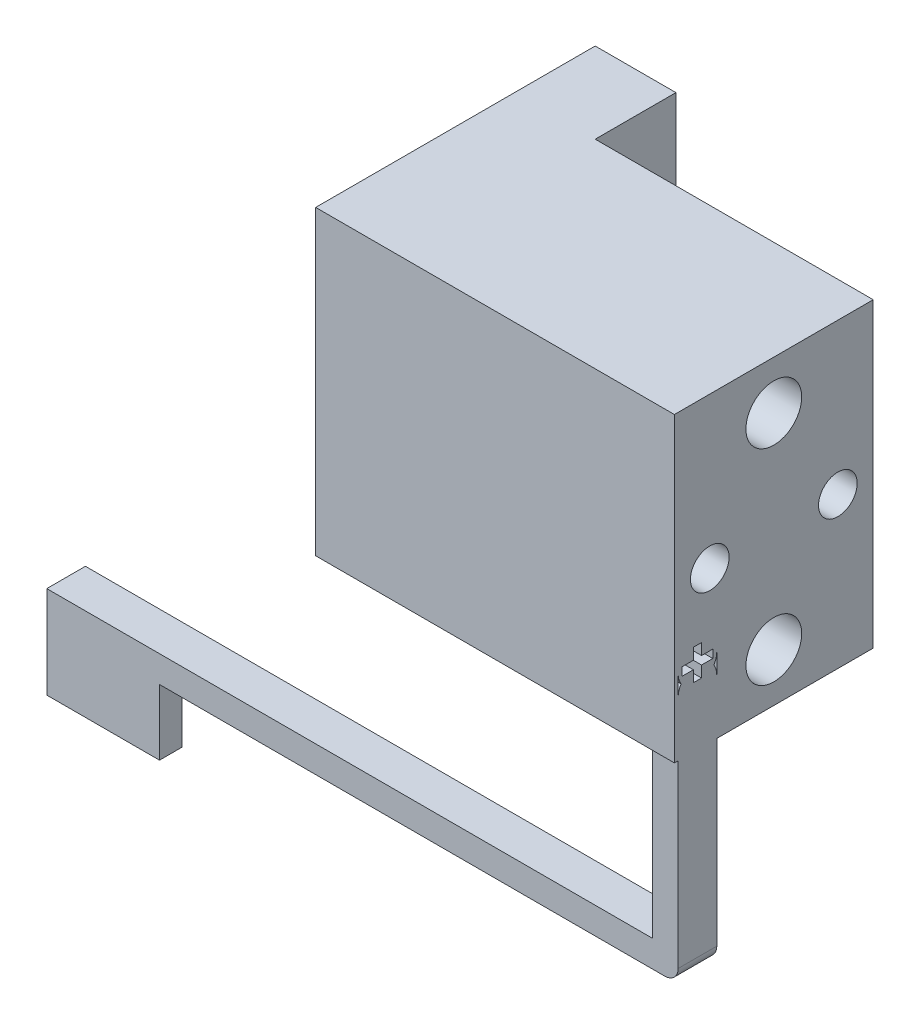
ISO-10303-21;
HEADER;
FILE_DESCRIPTION(('STEP AP214'),'2;1');
FILE_NAME('part.step','',(''),(''),'','','');
FILE_SCHEMA(('AUTOMOTIVE_DESIGN { 1 0 10303 214 1 1 1 1 }'));
ENDSEC;
DATA;
#1=APPLICATION_CONTEXT('core data for automotive mechanical design processes');
#2=APPLICATION_PROTOCOL_DEFINITION('international standard','automotive_design',2000,#1);
#3=PRODUCT_CONTEXT('',#1,'mechanical');
#4=PRODUCT('Part','Part','',(#3));
#5=PRODUCT_RELATED_PRODUCT_CATEGORY('part','',(#4));
#6=PRODUCT_DEFINITION_FORMATION('','',#4);
#7=PRODUCT_DEFINITION_CONTEXT('part definition',#1,'design');
#8=PRODUCT_DEFINITION('design','',#6,#7);
#9=PRODUCT_DEFINITION_SHAPE('','',#8);
#10=(LENGTH_UNIT() NAMED_UNIT(*) SI_UNIT(.MILLI.,.METRE.));
#11=(NAMED_UNIT(*) PLANE_ANGLE_UNIT() SI_UNIT($,.RADIAN.));
#12=(NAMED_UNIT(*) SI_UNIT($,.STERADIAN.) SOLID_ANGLE_UNIT());
#13=UNCERTAINTY_MEASURE_WITH_UNIT(LENGTH_MEASURE(1.E-05),#10,'distance_accuracy_value','');
#14=(GEOMETRIC_REPRESENTATION_CONTEXT(3) GLOBAL_UNCERTAINTY_ASSIGNED_CONTEXT((#13)) GLOBAL_UNIT_ASSIGNED_CONTEXT((#10,
#11,#12)) REPRESENTATION_CONTEXT('',''));
#15=CARTESIAN_POINT('',(0.,0.,0.));
#16=DIRECTION('',(0.,0.,1.));
#17=DIRECTION('',(1.,0.,0.));
#18=AXIS2_PLACEMENT_3D('',#15,#16,#17);
#19=CARTESIAN_POINT('',(17.6065,-4.73456999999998,29.7609599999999));
#20=DIRECTION('',(0.,0.,-1.));
#21=DIRECTION('',(-1.,0.,0.));
#22=AXIS2_PLACEMENT_3D('',#19,#20,#21);
#23=PLANE('',#22);
#24=DIRECTION('',(0.,1.,0.));
#25=VECTOR('',#24,1.);
#26=CARTESIAN_POINT('',(14.114,-1.05156999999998,29.7609599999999));
#27=LINE('',#26,#25);
#28=CARTESIAN_POINT('',(14.114,-2.70257000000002,29.7609599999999));
#29=VERTEX_POINT('',#28);
#30=CARTESIAN_POINT('',(14.114,-6.76657000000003,29.76096));
#31=VERTEX_POINT('',#30);
#32=EDGE_CURVE('E138',#29,#31,#27,.F.);
#33=ORIENTED_EDGE('',*,*,#32,.F.);
#34=DIRECTION('',(1.,0.,0.));
#35=VECTOR('',#34,1.);
#36=CARTESIAN_POINT('',(32.8465,-2.70257000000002,29.7609599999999));
#37=LINE('',#36,#35);
#38=CARTESIAN_POINT('',(21.099,-2.70257000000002,29.7609599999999));
#39=VERTEX_POINT('',#38);
#40=EDGE_CURVE('E316',#29,#39,#37,.T.);
#41=ORIENTED_EDGE('',*,*,#40,.T.);
#42=DIRECTION('',(0.,1.,0.));
#43=VECTOR('',#42,1.);
#44=CARTESIAN_POINT('',(21.099,-6.76657000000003,29.76096));
#45=LINE('',#44,#43);
#46=CARTESIAN_POINT('',(21.099,-6.76657000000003,29.76096));
#47=VERTEX_POINT('',#46);
#48=EDGE_CURVE('E277',#47,#39,#45,.T.);
#49=ORIENTED_EDGE('',*,*,#48,.F.);
#50=DIRECTION('',(1.,0.,0.));
#51=VECTOR('',#50,1.);
#52=CARTESIAN_POINT('',(14.114,-6.76657000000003,29.76096));
#53=LINE('',#52,#51);
#54=EDGE_CURVE('E278',#31,#47,#53,.T.);
#55=ORIENTED_EDGE('',*,*,#54,.F.);
#56=EDGE_LOOP('',(#33,#41,#49,#55));
#57=FACE_BOUND('',#56,.T.);
#58=ADVANCED_FACE('F32',(#57),#23,.T.);
#59=CARTESIAN_POINT('',(32.8465,-1.05157000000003,29.96035));
#60=DIRECTION('',(0.,1.,0.));
#61=DIRECTION('',(0.,0.,1.));
#62=AXIS2_PLACEMENT_3D('',#59,#60,#61);
#63=PLANE('',#62);
#64=DIRECTION('',(1.,0.,0.));
#65=VECTOR('',#64,1.);
#66=CARTESIAN_POINT('',(14.114,-1.05156999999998,31.15796));
#67=LINE('',#66,#65);
#68=CARTESIAN_POINT('',(51.6425,-1.05156999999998,31.15796));
#69=VERTEX_POINT('',#68);
#70=CARTESIAN_POINT('',(14.114,-1.05156999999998,31.15796));
#71=VERTEX_POINT('',#70);
#72=EDGE_CURVE('E146',#69,#71,#67,.F.);
#73=ORIENTED_EDGE('',*,*,#72,.F.);
#74=DIRECTION('',(0.,0.,1.));
#75=VECTOR('',#74,1.);
#76=CARTESIAN_POINT('',(51.6425,-1.05156999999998,31.15796));
#77=LINE('',#76,#75);
#78=CARTESIAN_POINT('',(51.6425,-1.05156999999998,28.76274));
#79=VERTEX_POINT('',#78);
#80=EDGE_CURVE('E328',#79,#69,#77,.T.);
#81=ORIENTED_EDGE('',*,*,#80,.F.);
#82=DIRECTION('',(-1.,0.,0.));
#83=VECTOR('',#82,1.);
#84=CARTESIAN_POINT('',(51.579,-1.05156999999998,28.76274));
#85=LINE('',#84,#83);
#86=CARTESIAN_POINT('',(14.114,-1.05156999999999,28.76274));
#87=VERTEX_POINT('',#86);
#88=EDGE_CURVE('E305',#87,#79,#85,.F.);
#89=ORIENTED_EDGE('',*,*,#88,.F.);
#90=DIRECTION('',(0.,0.,1.));
#91=VECTOR('',#90,1.);
#92=CARTESIAN_POINT('',(14.114,-1.05156999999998,28.76274));
#93=LINE('',#92,#91);
#94=EDGE_CURVE('E124',#71,#87,#93,.F.);
#95=ORIENTED_EDGE('',*,*,#94,.F.);
#96=EDGE_LOOP('',(#73,#81,#89,#95));
#97=FACE_BOUND('',#96,.T.);
#98=ADVANCED_FACE('F417',(#97),#63,.T.);
#99=CARTESIAN_POINT('',(14.114,-1.05156999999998,28.76274));
#100=DIRECTION('',(-1.,0.,0.));
#101=DIRECTION('',(0.,0.,1.));
#102=AXIS2_PLACEMENT_3D('',#99,#100,#101);
#103=PLANE('',#102);
#104=ORIENTED_EDGE('',*,*,#94,.T.);
#105=DIRECTION('',(0.,1.,0.));
#106=VECTOR('',#105,1.);
#107=CARTESIAN_POINT('',(14.114,-1.05156999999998,28.76274));
#108=LINE('',#107,#106);
#109=CARTESIAN_POINT('',(14.114,-2.70256999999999,28.76274));
#110=VERTEX_POINT('',#109);
#111=EDGE_CURVE('E307',#110,#87,#108,.T.);
#112=ORIENTED_EDGE('',*,*,#111,.F.);
#113=DIRECTION('',(0.,0.,1.));
#114=VECTOR('',#113,1.);
#115=CARTESIAN_POINT('',(14.114,-2.70257000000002,29.96035));
#116=LINE('',#115,#114);
#117=EDGE_CURVE('E314',#110,#29,#116,.T.);
#118=ORIENTED_EDGE('',*,*,#117,.T.);
#119=ORIENTED_EDGE('',*,*,#32,.T.);
#120=DIRECTION('',(0.,0.,-1.));
#121=VECTOR('',#120,1.);
#122=CARTESIAN_POINT('',(14.114,-6.76657000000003,31.15796));
#123=LINE('',#122,#121);
#124=CARTESIAN_POINT('',(14.114,-6.76657000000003,31.15796));
#125=VERTEX_POINT('',#124);
#126=EDGE_CURVE('E273',#125,#31,#123,.T.);
#127=ORIENTED_EDGE('',*,*,#126,.F.);
#128=DIRECTION('',(0.,1.,0.));
#129=VECTOR('',#128,1.);
#130=CARTESIAN_POINT('',(14.114,-1.05156999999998,31.15796));
#131=LINE('',#130,#129);
#132=EDGE_CURVE('E266',#71,#125,#131,.F.);
#133=ORIENTED_EDGE('',*,*,#132,.F.);
#134=EDGE_LOOP('',(#104,#112,#118,#119,#127,#133));
#135=FACE_BOUND('',#134,.T.);
#136=ADVANCED_FACE('F274',(#135),#103,.T.);
#137=CARTESIAN_POINT('',(14.114,-6.76657000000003,31.15796));
#138=DIRECTION('',(0.,-1.,0.));
#139=DIRECTION('',(0.,0.,-1.));
#140=AXIS2_PLACEMENT_3D('',#137,#138,#139);
#141=PLANE('',#140);
#142=DIRECTION('',(1.,0.,0.));
#143=VECTOR('',#142,1.);
#144=CARTESIAN_POINT('',(14.114,-6.76657000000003,31.15796));
#145=LINE('',#144,#143);
#146=CARTESIAN_POINT('',(21.099,-6.76657000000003,31.15796));
#147=VERTEX_POINT('',#146);
#148=EDGE_CURVE('E270',#125,#147,#145,.T.);
#149=ORIENTED_EDGE('',*,*,#148,.F.);
#150=ORIENTED_EDGE('',*,*,#126,.T.);
#151=ORIENTED_EDGE('',*,*,#54,.T.);
#152=DIRECTION('',(0.,0.,-1.));
#153=VECTOR('',#152,1.);
#154=CARTESIAN_POINT('',(21.099,-6.76657000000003,31.15796));
#155=LINE('',#154,#153);
#156=EDGE_CURVE('E282',#147,#47,#155,.T.);
#157=ORIENTED_EDGE('',*,*,#156,.F.);
#158=EDGE_LOOP('',(#149,#150,#151,#157));
#159=FACE_BOUND('',#158,.T.);
#160=ADVANCED_FACE('F280',(#159),#141,.T.);
#161=CARTESIAN_POINT('',(21.099,-6.76657000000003,31.15796));
#162=DIRECTION('',(1.,0.,0.));
#163=DIRECTION('',(0.,0.,-1.));
#164=AXIS2_PLACEMENT_3D('',#161,#162,#163);
#165=PLANE('',#164);
#166=DIRECTION('',(0.,1.,0.));
#167=VECTOR('',#166,1.);
#168=CARTESIAN_POINT('',(21.099,-1.05156999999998,31.15796));
#169=LINE('',#168,#167);
#170=CARTESIAN_POINT('',(21.099,-2.70257000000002,31.15796));
#171=VERTEX_POINT('',#170);
#172=EDGE_CURVE('E284',#147,#171,#169,.T.);
#173=ORIENTED_EDGE('',*,*,#172,.F.);
#174=ORIENTED_EDGE('',*,*,#156,.T.);
#175=ORIENTED_EDGE('',*,*,#48,.T.);
#176=DIRECTION('',(0.,0.,1.));
#177=VECTOR('',#176,1.);
#178=CARTESIAN_POINT('',(21.099,-2.70257000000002,29.96035));
#179=LINE('',#178,#177);
#180=EDGE_CURVE('E324',#39,#171,#179,.T.);
#181=ORIENTED_EDGE('',*,*,#180,.T.);
#182=EDGE_LOOP('',(#173,#174,#175,#181));
#183=FACE_BOUND('',#182,.T.);
#184=ADVANCED_FACE('F404',(#183),#165,.T.);
#185=CARTESIAN_POINT('',(32.8465,-2.70257000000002,29.96035));
#186=DIRECTION('',(0.,1.,0.));
#187=DIRECTION('',(0.,0.,1.));
#188=AXIS2_PLACEMENT_3D('',#185,#186,#187);
#189=PLANE('',#188);
#190=ORIENTED_EDGE('',*,*,#40,.F.);
#191=ORIENTED_EDGE('',*,*,#117,.F.);
#192=DIRECTION('',(-1.,0.,0.));
#193=VECTOR('',#192,1.);
#194=CARTESIAN_POINT('',(51.579,-2.70256999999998,28.76274));
#195=LINE('',#194,#193);
#196=CARTESIAN_POINT('',(52.4045,-2.70256999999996,28.76274));
#197=VERTEX_POINT('',#196);
#198=EDGE_CURVE('E311',#197,#110,#195,.T.);
#199=ORIENTED_EDGE('',*,*,#198,.F.);
#200=DIRECTION('',(0.,0.,1.));
#201=VECTOR('',#200,1.);
#202=CARTESIAN_POINT('',(52.4045,-2.70256999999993,28.76274));
#203=LINE('',#202,#201);
#204=CARTESIAN_POINT('',(52.4045,-2.70256999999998,31.15796));
#205=VERTEX_POINT('',#204);
#206=EDGE_CURVE('E112',#205,#197,#203,.F.);
#207=ORIENTED_EDGE('',*,*,#206,.F.);
#208=DIRECTION('',(1.,0.,0.));
#209=VECTOR('',#208,1.);
#210=CARTESIAN_POINT('',(14.114,-2.70257000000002,31.15796));
#211=LINE('',#210,#209);
#212=EDGE_CURVE('E286',#171,#205,#211,.T.);
#213=ORIENTED_EDGE('',*,*,#212,.F.);
#214=ORIENTED_EDGE('',*,*,#180,.F.);
#215=EDGE_LOOP('',(#190,#191,#199,#207,#213,#214));
#216=FACE_BOUND('',#215,.T.);
#217=ADVANCED_FACE('F409',(#216),#189,.F.);
#218=CARTESIAN_POINT('',(36.005,18.61565,16.5701));
#219=DIRECTION('',(-1.,0.,0.));
#220=DIRECTION('',(0.,0.,1.));
#221=AXIS2_PLACEMENT_3D('',#218,#219,#220);
#222=PLANE('',#221);
#223=DIRECTION('',(0.,1.,0.));
#224=VECTOR('',#223,1.);
#225=CARTESIAN_POINT('',(36.005,18.61565,14.0701));
#226=LINE('',#225,#224);
#227=CARTESIAN_POINT('',(36.005,9.26844999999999,14.0701));
#228=VERTEX_POINT('',#227);
#229=CARTESIAN_POINT('',(36.005,27.96285,14.0701));
#230=VERTEX_POINT('',#229);
#231=EDGE_CURVE('E398',#228,#230,#226,.T.);
#232=ORIENTED_EDGE('',*,*,#231,.T.);
#233=DIRECTION('',(0.,0.,-1.));
#234=VECTOR('',#233,1.);
#235=CARTESIAN_POINT('',(36.005,27.96285,25.2296));
#236=LINE('',#235,#234);
#237=CARTESIAN_POINT('',(36.005,27.96285,19.0701));
#238=VERTEX_POINT('',#237);
#239=EDGE_CURVE('E445',#230,#238,#236,.F.);
#240=ORIENTED_EDGE('',*,*,#239,.T.);
#241=DIRECTION('',(0.,1.,0.));
#242=VECTOR('',#241,1.);
#243=CARTESIAN_POINT('',(36.005,18.61565,19.0700999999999));
#244=LINE('',#243,#242);
#245=CARTESIAN_POINT('',(36.005,9.26844999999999,19.0701));
#246=VERTEX_POINT('',#245);
#247=EDGE_CURVE('E441',#246,#238,#244,.T.);
#248=ORIENTED_EDGE('',*,*,#247,.F.);
#249=DIRECTION('',(0.,0.,1.));
#250=VECTOR('',#249,1.);
#251=CARTESIAN_POINT('',(36.005,9.26845000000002,25.2296));
#252=LINE('',#251,#250);
#253=EDGE_CURVE('E459',#246,#228,#252,.F.);
#254=ORIENTED_EDGE('',*,*,#253,.T.);
#255=EDGE_LOOP('',(#232,#240,#248,#254));
#256=FACE_BOUND('',#255,.T.);
#257=ADVANCED_FACE('F812',(#256),#222,.F.);
#258=CARTESIAN_POINT('',(33.505,18.61565,14.0701));
#259=DIRECTION('',(0.,0.,1.));
#260=DIRECTION('',(1.,0.,0.));
#261=AXIS2_PLACEMENT_3D('',#258,#259,#260);
#262=PLANE('',#261);
#263=DIRECTION('',(1.,0.,0.));
#264=VECTOR('',#263,1.);
#265=CARTESIAN_POINT('',(21.48,9.26845000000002,14.0701));
#266=LINE('',#265,#264);
#267=CARTESIAN_POINT('',(31.005,9.26845,14.0701));
#268=VERTEX_POINT('',#267);
#269=EDGE_CURVE('E456',#228,#268,#266,.F.);
#270=ORIENTED_EDGE('',*,*,#269,.T.);
#271=DIRECTION('',(0.,1.,0.));
#272=VECTOR('',#271,1.);
#273=CARTESIAN_POINT('',(31.005,18.61565,14.0701));
#274=LINE('',#273,#272);
#275=CARTESIAN_POINT('',(31.005,27.96285,14.0701));
#276=VERTEX_POINT('',#275);
#277=EDGE_CURVE('E427',#268,#276,#274,.T.);
#278=ORIENTED_EDGE('',*,*,#277,.T.);
#279=DIRECTION('',(1.,0.,0.));
#280=VECTOR('',#279,1.);
#281=CARTESIAN_POINT('',(21.48,27.96285,14.0701));
#282=LINE('',#281,#280);
#283=EDGE_CURVE('E437',#276,#230,#282,.T.);
#284=ORIENTED_EDGE('',*,*,#283,.T.);
#285=ORIENTED_EDGE('',*,*,#231,.F.);
#286=EDGE_LOOP('',(#270,#278,#284,#285));
#287=FACE_BOUND('',#286,.T.);
#288=ADVANCED_FACE('F1051',(#287),#262,.F.);
#289=CARTESIAN_POINT('',(31.005,18.61565,25.2296));
#290=DIRECTION('',(1.,0.,0.));
#291=DIRECTION('',(0.,0.,-1.));
#292=AXIS2_PLACEMENT_3D('',#289,#290,#291);
#293=PLANE('',#292);
#294=DIRECTION('',(0.,1.,0.));
#295=VECTOR('',#294,1.);
#296=CARTESIAN_POINT('',(31.005,18.61565,31.3891));
#297=LINE('',#296,#295);
#298=CARTESIAN_POINT('',(31.005,9.26845000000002,31.3891));
#299=VERTEX_POINT('',#298);
#300=CARTESIAN_POINT('',(31.005,27.96285,31.3891));
#301=VERTEX_POINT('',#300);
#302=EDGE_CURVE('E387',#299,#301,#297,.T.);
#303=ORIENTED_EDGE('',*,*,#302,.T.);
#304=DIRECTION('',(0.,0.,-1.));
#305=VECTOR('',#304,1.);
#306=CARTESIAN_POINT('',(31.005,27.96285,25.2296));
#307=LINE('',#306,#305);
#308=EDGE_CURVE('E438',#301,#276,#307,.T.);
#309=ORIENTED_EDGE('',*,*,#308,.T.);
#310=ORIENTED_EDGE('',*,*,#277,.F.);
#311=DIRECTION('',(0.,0.,1.));
#312=VECTOR('',#311,1.);
#313=CARTESIAN_POINT('',(31.005,9.26845000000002,25.2296));
#314=LINE('',#313,#312);
#315=EDGE_CURVE('E385',#268,#299,#314,.T.);
#316=ORIENTED_EDGE('',*,*,#315,.T.);
#317=EDGE_LOOP('',(#303,#309,#310,#316));
#318=FACE_BOUND('',#317,.T.);
#319=ADVANCED_FACE('F1029',(#318),#293,.F.);
#320=CARTESIAN_POINT('',(51.5789999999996,14.0433036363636,29.96035));
#321=DIRECTION('',(1.,0.,0.));
#322=DIRECTION('',(0.,0.,-1.));
#323=AXIS2_PLACEMENT_3D('',#320,#321,#322);
#324=PLANE('',#323);
#325=DIRECTION('',(0.,1.,0.));
#326=VECTOR('',#325,1.);
#327=CARTESIAN_POINT('',(51.5789999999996,9.26845000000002,31.15796));
#328=LINE('',#327,#326);
#329=CARTESIAN_POINT('',(51.5789999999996,13.93443,31.15796));
#330=VERTEX_POINT('',#329);
#331=CARTESIAN_POINT('',(51.5789999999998,12.66443,31.15796));
#332=VERTEX_POINT('',#331);
#333=EDGE_CURVE('E394',#330,#332,#328,.F.);
#334=ORIENTED_EDGE('',*,*,#333,.T.);
#335=CARTESIAN_POINT('',(51.579,12.66443,29.96035));
#336=DIRECTION('',(1.,0.,0.));
#337=DIRECTION('',(0.,0.,-1.));
#338=AXIS2_PLACEMENT_3D('',#335,#336,#337);
#339=CIRCLE('',#338,1.19761);
#340=CARTESIAN_POINT('',(51.5789999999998,13.29943,30.9757537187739));
#341=VERTEX_POINT('',#340);
#342=EDGE_CURVE('E378',#341,#332,#339,.T.);
#343=ORIENTED_EDGE('',*,*,#342,.F.);
#344=CARTESIAN_POINT('',(51.5789999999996,13.93443,29.96035));
#345=DIRECTION('',(-1.,0.,0.));
#346=DIRECTION('',(0.,0.,1.));
#347=AXIS2_PLACEMENT_3D('',#344,#345,#346);
#348=CIRCLE('',#347,1.19761000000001);
#349=EDGE_CURVE('E382',#330,#341,#348,.F.);
#350=ORIENTED_EDGE('',*,*,#349,.F.);
#351=EDGE_LOOP('',(#334,#343,#350));
#352=FACE_BOUND('',#351,.T.);
#353=ADVANCED_FACE('F1020',(#352),#324,.T.);
#354=CARTESIAN_POINT('',(51.96,13.9344300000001,29.96035));
#355=DIRECTION('',(1.,0.,0.));
#356=DIRECTION('',(0.,0.,-1.));
#357=AXIS2_PLACEMENT_3D('',#354,#355,#356);
#358=PLANE('',#357);
#359=DIRECTION('',(0.,1.,0.));
#360=VECTOR('',#359,1.);
#361=CARTESIAN_POINT('',(51.96,14.1884300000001,30.91285));
#362=LINE('',#361,#360);
#363=CARTESIAN_POINT('',(51.96,14.1884300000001,30.91285));
#364=VERTEX_POINT('',#363);
#365=CARTESIAN_POINT('',(51.96,13.6804300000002,30.91285));
#366=VERTEX_POINT('',#365);
#367=EDGE_CURVE('E497',#364,#366,#362,.F.);
#368=ORIENTED_EDGE('',*,*,#367,.T.);
#369=DIRECTION('',(0.,0.,-1.));
#370=VECTOR('',#369,1.);
#371=CARTESIAN_POINT('',(51.96,13.6804300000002,30.91285));
#372=LINE('',#371,#370);
#373=CARTESIAN_POINT('',(51.96,13.6804300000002,30.2143499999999));
#374=VERTEX_POINT('',#373);
#375=EDGE_CURVE('E502',#366,#374,#372,.T.);
#376=ORIENTED_EDGE('',*,*,#375,.T.);
#377=DIRECTION('',(0.,1.,0.));
#378=VECTOR('',#377,1.);
#379=CARTESIAN_POINT('',(51.96,14.8869300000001,30.2143499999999));
#380=LINE('',#379,#378);
#381=CARTESIAN_POINT('',(51.96,12.9819300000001,30.2143499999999));
#382=VERTEX_POINT('',#381);
#383=EDGE_CURVE('E505',#374,#382,#380,.F.);
#384=ORIENTED_EDGE('',*,*,#383,.T.);
#385=DIRECTION('',(0.,0.,-1.));
#386=VECTOR('',#385,1.);
#387=CARTESIAN_POINT('',(51.96,12.9819300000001,30.2143499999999));
#388=LINE('',#387,#386);
#389=CARTESIAN_POINT('',(51.96,12.9819300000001,29.70635));
#390=VERTEX_POINT('',#389);
#391=EDGE_CURVE('E513',#382,#390,#388,.T.);
#392=ORIENTED_EDGE('',*,*,#391,.T.);
#393=DIRECTION('',(0.,1.,0.));
#394=VECTOR('',#393,1.);
#395=CARTESIAN_POINT('',(51.96,12.9819300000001,29.70635));
#396=LINE('',#395,#394);
#397=CARTESIAN_POINT('',(51.96,13.6804300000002,29.70635));
#398=VERTEX_POINT('',#397);
#399=EDGE_CURVE('E518',#390,#398,#396,.T.);
#400=ORIENTED_EDGE('',*,*,#399,.T.);
#401=DIRECTION('',(0.,0.,-1.));
#402=VECTOR('',#401,1.);
#403=CARTESIAN_POINT('',(51.96,13.6804300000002,30.91285));
#404=LINE('',#403,#402);
#405=CARTESIAN_POINT('',(51.96,13.6804300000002,29.00785));
#406=VERTEX_POINT('',#405);
#407=EDGE_CURVE('E521',#398,#406,#404,.T.);
#408=ORIENTED_EDGE('',*,*,#407,.T.);
#409=DIRECTION('',(0.,1.,0.));
#410=VECTOR('',#409,1.);
#411=CARTESIAN_POINT('',(51.96,13.6804300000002,29.00785));
#412=LINE('',#411,#410);
#413=CARTESIAN_POINT('',(51.96,14.1884300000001,29.00785));
#414=VERTEX_POINT('',#413);
#415=EDGE_CURVE('E467',#406,#414,#412,.T.);
#416=ORIENTED_EDGE('',*,*,#415,.T.);
#417=DIRECTION('',(0.,0.,1.));
#418=VECTOR('',#417,1.);
#419=CARTESIAN_POINT('',(51.96,14.1884300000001,29.00785));
#420=LINE('',#419,#418);
#421=CARTESIAN_POINT('',(51.96,14.1884300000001,29.70635));
#422=VERTEX_POINT('',#421);
#423=EDGE_CURVE('E470',#414,#422,#420,.T.);
#424=ORIENTED_EDGE('',*,*,#423,.T.);
#425=DIRECTION('',(0.,1.,0.));
#426=VECTOR('',#425,1.);
#427=CARTESIAN_POINT('',(51.96,12.9819300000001,29.70635));
#428=LINE('',#427,#426);
#429=CARTESIAN_POINT('',(51.96,14.8869300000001,29.70635));
#430=VERTEX_POINT('',#429);
#431=EDGE_CURVE('E473',#422,#430,#428,.T.);
#432=ORIENTED_EDGE('',*,*,#431,.T.);
#433=DIRECTION('',(0.,0.,1.));
#434=VECTOR('',#433,1.);
#435=CARTESIAN_POINT('',(51.96,14.8869300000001,29.70635));
#436=LINE('',#435,#434);
#437=CARTESIAN_POINT('',(51.96,14.8869300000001,30.2143499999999));
#438=VERTEX_POINT('',#437);
#439=EDGE_CURVE('E481',#430,#438,#436,.T.);
#440=ORIENTED_EDGE('',*,*,#439,.T.);
#441=DIRECTION('',(0.,1.,0.));
#442=VECTOR('',#441,1.);
#443=CARTESIAN_POINT('',(51.96,14.8869300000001,30.2143499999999));
#444=LINE('',#443,#442);
#445=CARTESIAN_POINT('',(51.96,14.1884300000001,30.2143499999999));
#446=VERTEX_POINT('',#445);
#447=EDGE_CURVE('E486',#438,#446,#444,.F.);
#448=ORIENTED_EDGE('',*,*,#447,.T.);
#449=DIRECTION('',(0.,0.,1.));
#450=VECTOR('',#449,1.);
#451=CARTESIAN_POINT('',(51.96,14.1884300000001,29.00785));
#452=LINE('',#451,#450);
#453=EDGE_CURVE('E489',#446,#364,#452,.T.);
#454=ORIENTED_EDGE('',*,*,#453,.T.);
#455=EDGE_LOOP('',(#368,#376,#384,#392,#400,#408,#416,#424,#432,#440,#448,#454));
#456=FACE_BOUND('',#455,.T.);
#457=ADVANCED_FACE('F1013',(#456),#358,.T.);
#458=CARTESIAN_POINT('',(51.5789999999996,14.0433036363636,29.96035));
#459=DIRECTION('',(1.,0.,0.));
#460=DIRECTION('',(0.,0.,-1.));
#461=AXIS2_PLACEMENT_3D('',#458,#459,#460);
#462=PLANE('',#461);
#463=CARTESIAN_POINT('',(51.579,12.66443,29.96035));
#464=DIRECTION('',(1.,0.,0.));
#465=DIRECTION('',(0.,0.,-1.));
#466=AXIS2_PLACEMENT_3D('',#463,#464,#465);
#467=CIRCLE('',#466,1.19761);
#468=CARTESIAN_POINT('',(51.579,12.66443,28.76274));
#469=VERTEX_POINT('',#468);
#470=CARTESIAN_POINT('',(51.579,13.2994299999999,28.944946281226));
#471=VERTEX_POINT('',#470);
#472=EDGE_CURVE('E374',#469,#471,#467,.T.);
#473=ORIENTED_EDGE('',*,*,#472,.F.);
#474=DIRECTION('',(0.,1.,0.));
#475=VECTOR('',#474,1.);
#476=CARTESIAN_POINT('',(51.579,13.93443,28.76274));
#477=LINE('',#476,#475);
#478=CARTESIAN_POINT('',(51.579,13.93443,28.76274));
#479=VERTEX_POINT('',#478);
#480=EDGE_CURVE('E376',#469,#479,#477,.T.);
#481=ORIENTED_EDGE('',*,*,#480,.T.);
#482=CARTESIAN_POINT('',(51.579,13.93443,29.96035));
#483=DIRECTION('',(-1.,0.,0.));
#484=DIRECTION('',(0.,0.,1.));
#485=AXIS2_PLACEMENT_3D('',#482,#483,#484);
#486=CIRCLE('',#485,1.19761000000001);
#487=EDGE_CURVE('E371',#471,#479,#486,.F.);
#488=ORIENTED_EDGE('',*,*,#487,.F.);
#489=EDGE_LOOP('',(#473,#481,#488));
#490=FACE_BOUND('',#489,.T.);
#491=ADVANCED_FACE('F617',(#490),#462,.T.);
#492=CARTESIAN_POINT('',(48.404,19.81326,29.19835));
#493=DIRECTION('',(-1.,0.,0.));
#494=DIRECTION('',(0.,0.,1.));
#495=AXIS2_PLACEMENT_3D('',#492,#493,#494);
#496=PLANE('',#495);
#497=CARTESIAN_POINT('',(48.404,18.61565,29.1983499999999));
#498=DIRECTION('',(-1.,0.,0.));
#499=DIRECTION('',(0.,0.,1.));
#500=AXIS2_PLACEMENT_3D('',#497,#498,#499);
#501=CIRCLE('',#500,1.19761);
#502=CARTESIAN_POINT('',(48.404,18.61565,30.3959599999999));
#503=VERTEX_POINT('',#502);
#504=EDGE_CURVE('E368',#503,#503,#501,.F.);
#505=ORIENTED_EDGE('',*,*,#504,.T.);
#506=EDGE_LOOP('',(#505));
#507=FACE_BOUND('',#506,.T.);
#508=ADVANCED_FACE('F677',(#507),#496,.F.);
#509=CARTESIAN_POINT('',(46.88,12.4226681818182,25.2296));
#510=DIRECTION('',(-1.,0.,0.));
#511=DIRECTION('',(0.,0.,1.));
#512=AXIS2_PLACEMENT_3D('',#509,#510,#511);
#513=PLANE('',#512);
#514=CARTESIAN_POINT('',(46.88,12.26565,25.2295999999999));
#515=DIRECTION('',(-1.,0.,0.));
#516=DIRECTION('',(0.,0.,1.));
#517=AXIS2_PLACEMENT_3D('',#514,#515,#516);
#518=CIRCLE('',#517,1.7272);
#519=CARTESIAN_POINT('',(46.88,12.26565,26.9567999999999));
#520=VERTEX_POINT('',#519);
#521=EDGE_CURVE('E365',#520,#520,#518,.F.);
#522=ORIENTED_EDGE('',*,*,#521,.T.);
#523=EDGE_LOOP('',(#522));
#524=FACE_BOUND('',#523,.T.);
#525=ADVANCED_FACE('F674',(#524),#513,.F.);
#526=CARTESIAN_POINT('',(46.88,25.1226681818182,25.2296));
#527=DIRECTION('',(-1.,0.,0.));
#528=DIRECTION('',(0.,0.,1.));
#529=AXIS2_PLACEMENT_3D('',#526,#527,#528);
#530=PLANE('',#529);
#531=CARTESIAN_POINT('',(46.88,24.96565,25.2295999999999));
#532=DIRECTION('',(-1.,0.,0.));
#533=DIRECTION('',(0.,0.,1.));
#534=AXIS2_PLACEMENT_3D('',#531,#532,#533);
#535=CIRCLE('',#534,1.7272);
#536=CARTESIAN_POINT('',(46.88,24.96565,26.9567999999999));
#537=VERTEX_POINT('',#536);
#538=EDGE_CURVE('E361',#537,#537,#535,.F.);
#539=ORIENTED_EDGE('',*,*,#538,.T.);
#540=EDGE_LOOP('',(#539));
#541=FACE_BOUND('',#540,.T.);
#542=ADVANCED_FACE('F676',(#541),#530,.F.);
#543=CARTESIAN_POINT('',(51.579,-1.05156999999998,28.76274));
#544=DIRECTION('',(0.,0.,-1.));
#545=DIRECTION('',(-1.,0.,0.));
#546=AXIS2_PLACEMENT_3D('',#543,#544,#545);
#547=PLANE('',#546);
#548=ORIENTED_EDGE('',*,*,#88,.T.);
#549=DIRECTION('',(0.,-1.,0.));
#550=VECTOR('',#549,1.);
#551=CARTESIAN_POINT('',(51.6425,-1.05156999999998,28.76274));
#552=LINE('',#551,#550);
#553=CARTESIAN_POINT('',(51.6425,9.26845000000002,28.76274));
#554=VERTEX_POINT('',#553);
#555=EDGE_CURVE('E420',#554,#79,#552,.T.);
#556=ORIENTED_EDGE('',*,*,#555,.F.);
#557=DIRECTION('',(1.,0.,0.));
#558=VECTOR('',#557,1.);
#559=CARTESIAN_POINT('',(21.48,9.26845000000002,28.76274));
#560=LINE('',#559,#558);
#561=CARTESIAN_POINT('',(53.23,9.26844999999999,28.76274));
#562=VERTEX_POINT('',#561);
#563=EDGE_CURVE('E36',#554,#562,#560,.T.);
#564=ORIENTED_EDGE('',*,*,#563,.T.);
#565=DIRECTION('',(0.,1.,0.));
#566=VECTOR('',#565,1.);
#567=CARTESIAN_POINT('',(53.23,18.61565,28.76274));
#568=LINE('',#567,#566);
#569=CARTESIAN_POINT('',(53.23,-1.87707,28.76274));
#570=VERTEX_POINT('',#569);
#571=EDGE_CURVE('E364',#562,#570,#568,.F.);
#572=ORIENTED_EDGE('',*,*,#571,.T.);
#573=CARTESIAN_POINT('',(52.4045,-1.87706999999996,28.76274));
#574=DIRECTION('',(0.,0.,1.));
#575=DIRECTION('',(0.,-1.,0.));
#576=AXIS2_PLACEMENT_3D('',#573,#574,#575);
#577=CIRCLE('',#576,0.825499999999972);
#578=EDGE_CURVE('E302',#197,#570,#577,.T.);
#579=ORIENTED_EDGE('',*,*,#578,.F.);
#580=ORIENTED_EDGE('',*,*,#198,.T.);
#581=ORIENTED_EDGE('',*,*,#111,.T.);
#582=EDGE_LOOP('',(#548,#556,#564,#572,#579,#580,#581));
#583=FACE_BOUND('',#582,.T.);
#584=ADVANCED_FACE('F414',(#583),#547,.T.);
#585=CARTESIAN_POINT('',(52.4045,-1.87706999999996,28.76274));
#586=DIRECTION('',(0.,0.,1.));
#587=DIRECTION('',(0.,-1.,0.));
#588=AXIS2_PLACEMENT_3D('',#585,#586,#587);
#589=CYLINDRICAL_SURFACE('',#588,0.825499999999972);
#590=ORIENTED_EDGE('',*,*,#578,.T.);
#591=DIRECTION('',(0.,0.,1.));
#592=VECTOR('',#591,1.);
#593=CARTESIAN_POINT('',(53.23,-1.87707000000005,25.2296));
#594=LINE('',#593,#592);
#595=CARTESIAN_POINT('',(53.23,-1.87707,31.15796));
#596=VERTEX_POINT('',#595);
#597=EDGE_CURVE('E590',#570,#596,#594,.T.);
#598=ORIENTED_EDGE('',*,*,#597,.T.);
#599=CARTESIAN_POINT('',(52.4045,-1.87706999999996,31.15796));
#600=DIRECTION('',(0.,0.,1.));
#601=DIRECTION('',(0.,-1.,0.));
#602=AXIS2_PLACEMENT_3D('',#599,#600,#601);
#603=CIRCLE('',#602,0.825499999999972);
#604=EDGE_CURVE('E386',#205,#596,#603,.T.);
#605=ORIENTED_EDGE('',*,*,#604,.F.);
#606=ORIENTED_EDGE('',*,*,#206,.T.);
#607=EDGE_LOOP('',(#590,#598,#605,#606));
#608=FACE_BOUND('',#607,.T.);
#609=ADVANCED_FACE('F691',(#608),#589,.T.);
#610=CARTESIAN_POINT('',(14.114,-1.05156999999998,31.15796));
#611=DIRECTION('',(0.,0.,1.));
#612=DIRECTION('',(1.,0.,0.));
#613=AXIS2_PLACEMENT_3D('',#610,#611,#612);
#614=PLANE('',#613);
#615=DIRECTION('',(0.,1.,0.));
#616=VECTOR('',#615,1.);
#617=CARTESIAN_POINT('',(51.6425,9.26845000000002,31.15796));
#618=LINE('',#617,#616);
#619=CARTESIAN_POINT('',(51.6425,9.26845000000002,31.15796));
#620=VERTEX_POINT('',#619);
#621=EDGE_CURVE('E1095',#69,#620,#618,.T.);
#622=ORIENTED_EDGE('',*,*,#621,.F.);
#623=ORIENTED_EDGE('',*,*,#72,.T.);
#624=ORIENTED_EDGE('',*,*,#132,.T.);
#625=ORIENTED_EDGE('',*,*,#148,.T.);
#626=ORIENTED_EDGE('',*,*,#172,.T.);
#627=ORIENTED_EDGE('',*,*,#212,.T.);
#628=ORIENTED_EDGE('',*,*,#604,.T.);
#629=DIRECTION('',(0.,1.,0.));
#630=VECTOR('',#629,1.);
#631=CARTESIAN_POINT('',(53.23,18.61565,31.15796));
#632=LINE('',#631,#630);
#633=CARTESIAN_POINT('',(53.23,9.26845000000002,31.15796));
#634=VERTEX_POINT('',#633);
#635=EDGE_CURVE('E592',#596,#634,#632,.T.);
#636=ORIENTED_EDGE('',*,*,#635,.T.);
#637=DIRECTION('',(1.,0.,0.));
#638=VECTOR('',#637,1.);
#639=CARTESIAN_POINT('',(21.48,9.26845000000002,31.15796));
#640=LINE('',#639,#638);
#641=EDGE_CURVE('E466',#634,#620,#640,.F.);
#642=ORIENTED_EDGE('',*,*,#641,.T.);
#643=EDGE_LOOP('',(#622,#623,#624,#625,#626,#627,#628,#636,#642));
#644=FACE_BOUND('',#643,.T.);
#645=ADVANCED_FACE('F268',(#644),#614,.T.);
#646=CARTESIAN_POINT('',(21.48,18.61565,31.3891));
#647=DIRECTION('',(0.,0.,-1.));
#648=DIRECTION('',(-1.,0.,0.));
#649=AXIS2_PLACEMENT_3D('',#646,#647,#648);
#650=PLANE('',#649);
#651=DIRECTION('',(1.,0.,0.));
#652=VECTOR('',#651,1.);
#653=CARTESIAN_POINT('',(21.48,9.26845000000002,31.3891));
#654=LINE('',#653,#652);
#655=CARTESIAN_POINT('',(53.23,9.26845000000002,31.3891));
#656=VERTEX_POINT('',#655);
#657=EDGE_CURVE('E452',#299,#656,#654,.T.);
#658=ORIENTED_EDGE('',*,*,#657,.T.);
#659=DIRECTION('',(0.,1.,0.));
#660=VECTOR('',#659,1.);
#661=CARTESIAN_POINT('',(53.23,18.61565,31.3891));
#662=LINE('',#661,#660);
#663=CARTESIAN_POINT('',(53.23,27.9628500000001,31.3891));
#664=VERTEX_POINT('',#663);
#665=EDGE_CURVE('E575',#656,#664,#662,.T.);
#666=ORIENTED_EDGE('',*,*,#665,.T.);
#667=DIRECTION('',(1.,0.,0.));
#668=VECTOR('',#667,1.);
#669=CARTESIAN_POINT('',(21.48,27.96285,31.3891));
#670=LINE('',#669,#668);
#671=EDGE_CURVE('E442',#664,#301,#670,.F.);
#672=ORIENTED_EDGE('',*,*,#671,.T.);
#673=ORIENTED_EDGE('',*,*,#302,.F.);
#674=EDGE_LOOP('',(#658,#666,#672,#673));
#675=FACE_BOUND('',#674,.T.);
#676=ADVANCED_FACE('F696',(#675),#650,.F.);
#677=CARTESIAN_POINT('',(21.48,27.96285,25.2296));
#678=DIRECTION('',(0.,-1.,0.));
#679=DIRECTION('',(0.,0.,-1.));
#680=AXIS2_PLACEMENT_3D('',#677,#678,#679);
#681=PLANE('',#680);
#682=ORIENTED_EDGE('',*,*,#671,.F.);
#683=DIRECTION('',(0.,0.,1.));
#684=VECTOR('',#683,1.);
#685=CARTESIAN_POINT('',(53.23,27.9628500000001,25.2296));
#686=LINE('',#685,#684);
#687=CARTESIAN_POINT('',(53.23,27.96285,19.0701));
#688=VERTEX_POINT('',#687);
#689=EDGE_CURVE('E572',#664,#688,#686,.F.);
#690=ORIENTED_EDGE('',*,*,#689,.T.);
#691=DIRECTION('',(-1.,0.,0.));
#692=VECTOR('',#691,1.);
#693=CARTESIAN_POINT('',(21.48,27.96285,19.0700999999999));
#694=LINE('',#693,#692);
#695=EDGE_CURVE('E450',#238,#688,#694,.F.);
#696=ORIENTED_EDGE('',*,*,#695,.F.);
#697=ORIENTED_EDGE('',*,*,#239,.F.);
#698=ORIENTED_EDGE('',*,*,#283,.F.);
#699=ORIENTED_EDGE('',*,*,#308,.F.);
#700=EDGE_LOOP('',(#682,#690,#696,#697,#698,#699));
#701=FACE_BOUND('',#700,.T.);
#702=ADVANCED_FACE('F699',(#701),#681,.F.);
#703=CARTESIAN_POINT('',(21.48,18.61565,19.0700999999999));
#704=DIRECTION('',(0.,0.,-1.));
#705=DIRECTION('',(-1.,0.,0.));
#706=AXIS2_PLACEMENT_3D('',#703,#704,#705);
#707=PLANE('',#706);
#708=DIRECTION('',(0.,1.,0.));
#709=VECTOR('',#708,1.);
#710=CARTESIAN_POINT('',(53.23,18.61565,19.0700999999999));
#711=LINE('',#710,#709);
#712=CARTESIAN_POINT('',(53.23,9.26844999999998,19.0700999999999));
#713=VERTEX_POINT('',#712);
#714=EDGE_CURVE('E569',#688,#713,#711,.F.);
#715=ORIENTED_EDGE('',*,*,#714,.T.);
#716=DIRECTION('',(1.,0.,0.));
#717=VECTOR('',#716,1.);
#718=CARTESIAN_POINT('',(21.48,9.26845000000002,19.0701));
#719=LINE('',#718,#717);
#720=EDGE_CURVE('E462',#713,#246,#719,.F.);
#721=ORIENTED_EDGE('',*,*,#720,.T.);
#722=ORIENTED_EDGE('',*,*,#247,.T.);
#723=ORIENTED_EDGE('',*,*,#695,.T.);
#724=EDGE_LOOP('',(#715,#721,#722,#723));
#725=FACE_BOUND('',#724,.T.);
#726=ADVANCED_FACE('F703',(#725),#707,.T.);
#727=CARTESIAN_POINT('',(21.48,9.26845000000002,25.2296));
#728=DIRECTION('',(0.,1.,0.));
#729=DIRECTION('',(0.,0.,1.));
#730=AXIS2_PLACEMENT_3D('',#727,#728,#729);
#731=PLANE('',#730);
#732=ORIENTED_EDGE('',*,*,#563,.F.);
#733=DIRECTION('',(0.,0.,-1.));
#734=VECTOR('',#733,1.);
#735=CARTESIAN_POINT('',(51.6425,9.26845000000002,28.76274));
#736=LINE('',#735,#734);
#737=EDGE_CURVE('E422',#620,#554,#736,.T.);
#738=ORIENTED_EDGE('',*,*,#737,.F.);
#739=ORIENTED_EDGE('',*,*,#641,.F.);
#740=DIRECTION('',(0.,0.,1.));
#741=VECTOR('',#740,1.);
#742=CARTESIAN_POINT('',(53.23,9.26845000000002,25.2296));
#743=LINE('',#742,#741);
#744=EDGE_CURVE('E578',#634,#656,#743,.T.);
#745=ORIENTED_EDGE('',*,*,#744,.T.);
#746=ORIENTED_EDGE('',*,*,#657,.F.);
#747=ORIENTED_EDGE('',*,*,#315,.F.);
#748=ORIENTED_EDGE('',*,*,#269,.F.);
#749=ORIENTED_EDGE('',*,*,#253,.F.);
#750=ORIENTED_EDGE('',*,*,#720,.F.);
#751=DIRECTION('',(0.,0.,1.));
#752=VECTOR('',#751,1.);
#753=CARTESIAN_POINT('',(53.23,9.26844999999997,25.2296));
#754=LINE('',#753,#752);
#755=EDGE_CURVE('E360',#713,#562,#754,.T.);
#756=ORIENTED_EDGE('',*,*,#755,.T.);
#757=EDGE_LOOP('',(#732,#738,#739,#745,#746,#747,#748,#749,#750,#756));
#758=FACE_BOUND('',#757,.T.);
#759=ADVANCED_FACE('F707',(#758),#731,.F.);
#760=CARTESIAN_POINT('',(53.23,13.93443,29.96035));
#761=DIRECTION('',(-1.,0.,0.));
#762=DIRECTION('',(0.,0.,1.));
#763=AXIS2_PLACEMENT_3D('',#760,#761,#762);
#764=CYLINDRICAL_SURFACE('',#763,1.19761000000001);
#765=DIRECTION('',(1.,0.,0.));
#766=VECTOR('',#765,1.);
#767=CARTESIAN_POINT('',(51.5789999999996,13.93443,31.15796));
#768=LINE('',#767,#766);
#769=CARTESIAN_POINT('',(53.23,13.93443,31.15796));
#770=VERTEX_POINT('',#769);
#771=EDGE_CURVE('E384',#770,#330,#768,.F.);
#772=ORIENTED_EDGE('',*,*,#771,.T.);
#773=ORIENTED_EDGE('',*,*,#349,.T.);
#774=DIRECTION('',(1.,0.,0.));
#775=VECTOR('',#774,1.);
#776=CARTESIAN_POINT('',(51.579,13.29943,30.9757537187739));
#777=LINE('',#776,#775);
#778=CARTESIAN_POINT('',(53.23,13.29943,30.9757537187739));
#779=VERTEX_POINT('',#778);
#780=EDGE_CURVE('E381',#779,#341,#777,.F.);
#781=ORIENTED_EDGE('',*,*,#780,.F.);
#782=CARTESIAN_POINT('',(53.23,13.93443,29.96035));
#783=DIRECTION('',(-1.,0.,0.));
#784=DIRECTION('',(0.,0.,1.));
#785=AXIS2_PLACEMENT_3D('',#782,#783,#784);
#786=CIRCLE('',#785,1.19761000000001);
#787=EDGE_CURVE('E357',#779,#770,#786,.T.);
#788=ORIENTED_EDGE('',*,*,#787,.T.);
#789=EDGE_LOOP('',(#772,#773,#781,#788));
#790=FACE_BOUND('',#789,.T.);
#791=ADVANCED_FACE('F711',(#790),#764,.T.);
#792=CARTESIAN_POINT('',(51.5789999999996,9.26845000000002,31.15796));
#793=DIRECTION('',(0.,0.,1.));
#794=DIRECTION('',(1.,0.,0.));
#795=AXIS2_PLACEMENT_3D('',#792,#793,#794);
#796=PLANE('',#795);
#797=ORIENTED_EDGE('',*,*,#333,.F.);
#798=ORIENTED_EDGE('',*,*,#771,.F.);
#799=DIRECTION('',(0.,1.,0.));
#800=VECTOR('',#799,1.);
#801=CARTESIAN_POINT('',(53.23,18.61565,31.15796));
#802=LINE('',#801,#800);
#803=CARTESIAN_POINT('',(53.23,12.66443,31.15796));
#804=VERTEX_POINT('',#803);
#805=EDGE_CURVE('E356',#770,#804,#802,.F.);
#806=ORIENTED_EDGE('',*,*,#805,.T.);
#807=DIRECTION('',(1.,0.,0.));
#808=VECTOR('',#807,1.);
#809=CARTESIAN_POINT('',(51.579,12.66443,31.15796));
#810=LINE('',#809,#808);
#811=EDGE_CURVE('E380',#332,#804,#810,.T.);
#812=ORIENTED_EDGE('',*,*,#811,.F.);
#813=EDGE_LOOP('',(#797,#798,#806,#812));
#814=FACE_BOUND('',#813,.T.);
#815=ADVANCED_FACE('F715',(#814),#796,.F.);
#816=CARTESIAN_POINT('',(51.579,12.66443,29.96035));
#817=DIRECTION('',(1.,0.,0.));
#818=DIRECTION('',(0.,0.,-1.));
#819=AXIS2_PLACEMENT_3D('',#816,#817,#818);
#820=CYLINDRICAL_SURFACE('',#819,1.19761);
#821=ORIENTED_EDGE('',*,*,#811,.T.);
#822=CARTESIAN_POINT('',(53.23,12.66443,29.96035));
#823=DIRECTION('',(1.,0.,0.));
#824=DIRECTION('',(0.,0.,-1.));
#825=AXIS2_PLACEMENT_3D('',#822,#823,#824);
#826=CIRCLE('',#825,1.19761);
#827=EDGE_CURVE('E352',#804,#779,#826,.F.);
#828=ORIENTED_EDGE('',*,*,#827,.T.);
#829=ORIENTED_EDGE('',*,*,#780,.T.);
#830=ORIENTED_EDGE('',*,*,#342,.T.);
#831=EDGE_LOOP('',(#821,#828,#829,#830));
#832=FACE_BOUND('',#831,.T.);
#833=ADVANCED_FACE('F719',(#832),#820,.T.);
#834=CARTESIAN_POINT('',(53.23,13.6804300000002,29.00785));
#835=DIRECTION('',(0.,0.,-1.));
#836=DIRECTION('',(-1.,0.,0.));
#837=AXIS2_PLACEMENT_3D('',#834,#835,#836);
#838=PLANE('',#837);
#839=DIRECTION('',(1.,0.,0.));
#840=VECTOR('',#839,1.);
#841=CARTESIAN_POINT('',(53.23,13.6804300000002,29.00785));
#842=LINE('',#841,#840);
#843=CARTESIAN_POINT('',(53.23,13.6804300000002,29.00785));
#844=VERTEX_POINT('',#843);
#845=EDGE_CURVE('E526',#406,#844,#842,.T.);
#846=ORIENTED_EDGE('',*,*,#845,.T.);
#847=DIRECTION('',(0.,1.,0.));
#848=VECTOR('',#847,1.);
#849=CARTESIAN_POINT('',(53.23,18.61565,29.00785));
#850=LINE('',#849,#848);
#851=CARTESIAN_POINT('',(53.23,14.1884300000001,29.00785));
#852=VERTEX_POINT('',#851);
#853=EDGE_CURVE('E355',#844,#852,#850,.T.);
#854=ORIENTED_EDGE('',*,*,#853,.T.);
#855=DIRECTION('',(1.,0.,0.));
#856=VECTOR('',#855,1.);
#857=CARTESIAN_POINT('',(53.23,14.1884300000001,29.00785));
#858=LINE('',#857,#856);
#859=EDGE_CURVE('E469',#852,#414,#858,.F.);
#860=ORIENTED_EDGE('',*,*,#859,.T.);
#861=ORIENTED_EDGE('',*,*,#415,.F.);
#862=EDGE_LOOP('',(#846,#854,#860,#861));
#863=FACE_BOUND('',#862,.T.);
#864=ADVANCED_FACE('F723',(#863),#838,.F.);
#865=CARTESIAN_POINT('',(53.23,14.1884300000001,29.00785));
#866=DIRECTION('',(0.,1.,0.));
#867=DIRECTION('',(0.,0.,1.));
#868=AXIS2_PLACEMENT_3D('',#865,#866,#867);
#869=PLANE('',#868);
#870=ORIENTED_EDGE('',*,*,#423,.F.);
#871=ORIENTED_EDGE('',*,*,#859,.F.);
#872=DIRECTION('',(0.,0.,1.));
#873=VECTOR('',#872,1.);
#874=CARTESIAN_POINT('',(53.23,14.1884300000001,25.2296));
#875=LINE('',#874,#873);
#876=CARTESIAN_POINT('',(53.23,14.1884300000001,29.70635));
#877=VERTEX_POINT('',#876);
#878=EDGE_CURVE('E562',#852,#877,#875,.T.);
#879=ORIENTED_EDGE('',*,*,#878,.T.);
#880=DIRECTION('',(-1.,0.,0.));
#881=VECTOR('',#880,1.);
#882=CARTESIAN_POINT('',(53.23,14.1884300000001,29.70635));
#883=LINE('',#882,#881);
#884=EDGE_CURVE('E476',#877,#422,#883,.T.);
#885=ORIENTED_EDGE('',*,*,#884,.T.);
#886=EDGE_LOOP('',(#870,#871,#879,#885));
#887=FACE_BOUND('',#886,.T.);
#888=ADVANCED_FACE('F727',(#887),#869,.F.);
#889=CARTESIAN_POINT('',(53.23,12.9819300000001,29.70635));
#890=DIRECTION('',(0.,0.,-1.));
#891=DIRECTION('',(-1.,0.,0.));
#892=AXIS2_PLACEMENT_3D('',#889,#890,#891);
#893=PLANE('',#892);
#894=DIRECTION('',(0.,1.,0.));
#895=VECTOR('',#894,1.);
#896=CARTESIAN_POINT('',(53.23,18.61565,29.70635));
#897=LINE('',#896,#895);
#898=CARTESIAN_POINT('',(53.23,14.8869300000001,29.70635));
#899=VERTEX_POINT('',#898);
#900=EDGE_CURVE('E559',#877,#899,#897,.T.);
#901=ORIENTED_EDGE('',*,*,#900,.T.);
#902=DIRECTION('',(1.,0.,0.));
#903=VECTOR('',#902,1.);
#904=CARTESIAN_POINT('',(53.23,14.8869300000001,29.70635));
#905=LINE('',#904,#903);
#906=EDGE_CURVE('E479',#899,#430,#905,.F.);
#907=ORIENTED_EDGE('',*,*,#906,.T.);
#908=ORIENTED_EDGE('',*,*,#431,.F.);
#909=ORIENTED_EDGE('',*,*,#884,.F.);
#910=EDGE_LOOP('',(#901,#907,#908,#909));
#911=FACE_BOUND('',#910,.T.);
#912=ADVANCED_FACE('F731',(#911),#893,.F.);
#913=CARTESIAN_POINT('',(53.23,14.8869300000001,29.70635));
#914=DIRECTION('',(0.,1.,0.));
#915=DIRECTION('',(0.,0.,1.));
#916=AXIS2_PLACEMENT_3D('',#913,#914,#915);
#917=PLANE('',#916);
#918=ORIENTED_EDGE('',*,*,#906,.F.);
#919=DIRECTION('',(0.,0.,1.));
#920=VECTOR('',#919,1.);
#921=CARTESIAN_POINT('',(53.23,14.8869300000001,25.2296));
#922=LINE('',#921,#920);
#923=CARTESIAN_POINT('',(53.23,14.8869300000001,30.2143499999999));
#924=VERTEX_POINT('',#923);
#925=EDGE_CURVE('E556',#899,#924,#922,.T.);
#926=ORIENTED_EDGE('',*,*,#925,.T.);
#927=DIRECTION('',(1.,0.,0.));
#928=VECTOR('',#927,1.);
#929=CARTESIAN_POINT('',(53.23,14.8869300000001,30.2143499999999));
#930=LINE('',#929,#928);
#931=EDGE_CURVE('E483',#924,#438,#930,.F.);
#932=ORIENTED_EDGE('',*,*,#931,.T.);
#933=ORIENTED_EDGE('',*,*,#439,.F.);
#934=EDGE_LOOP('',(#918,#926,#932,#933));
#935=FACE_BOUND('',#934,.T.);
#936=ADVANCED_FACE('F735',(#935),#917,.F.);
#937=CARTESIAN_POINT('',(53.23,14.8869300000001,30.2143499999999));
#938=DIRECTION('',(0.,0.,1.));
#939=DIRECTION('',(1.,0.,0.));
#940=AXIS2_PLACEMENT_3D('',#937,#938,#939);
#941=PLANE('',#940);
#942=ORIENTED_EDGE('',*,*,#447,.F.);
#943=ORIENTED_EDGE('',*,*,#931,.F.);
#944=DIRECTION('',(0.,1.,0.));
#945=VECTOR('',#944,1.);
#946=CARTESIAN_POINT('',(53.23,18.61565,30.2143499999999));
#947=LINE('',#946,#945);
#948=CARTESIAN_POINT('',(53.23,14.1884300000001,30.2143499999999));
#949=VERTEX_POINT('',#948);
#950=EDGE_CURVE('E553',#924,#949,#947,.F.);
#951=ORIENTED_EDGE('',*,*,#950,.T.);
#952=DIRECTION('',(1.,0.,0.));
#953=VECTOR('',#952,1.);
#954=CARTESIAN_POINT('',(53.23,14.1884300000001,30.2143499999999));
#955=LINE('',#954,#953);
#956=EDGE_CURVE('E492',#949,#446,#955,.F.);
#957=ORIENTED_EDGE('',*,*,#956,.T.);
#958=EDGE_LOOP('',(#942,#943,#951,#957));
#959=FACE_BOUND('',#958,.T.);
#960=ADVANCED_FACE('F739',(#959),#941,.F.);
#961=CARTESIAN_POINT('',(53.23,14.1884300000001,29.00785));
#962=DIRECTION('',(0.,1.,0.));
#963=DIRECTION('',(0.,0.,1.));
#964=AXIS2_PLACEMENT_3D('',#961,#962,#963);
#965=PLANE('',#964);
#966=DIRECTION('',(0.,0.,1.));
#967=VECTOR('',#966,1.);
#968=CARTESIAN_POINT('',(53.23,14.1884300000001,25.2296));
#969=LINE('',#968,#967);
#970=CARTESIAN_POINT('',(53.23,14.1884300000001,30.91285));
#971=VERTEX_POINT('',#970);
#972=EDGE_CURVE('E550',#949,#971,#969,.T.);
#973=ORIENTED_EDGE('',*,*,#972,.T.);
#974=DIRECTION('',(1.,0.,0.));
#975=VECTOR('',#974,1.);
#976=CARTESIAN_POINT('',(53.23,14.1884300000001,30.91285));
#977=LINE('',#976,#975);
#978=EDGE_CURVE('E495',#971,#364,#977,.F.);
#979=ORIENTED_EDGE('',*,*,#978,.T.);
#980=ORIENTED_EDGE('',*,*,#453,.F.);
#981=ORIENTED_EDGE('',*,*,#956,.F.);
#982=EDGE_LOOP('',(#973,#979,#980,#981));
#983=FACE_BOUND('',#982,.T.);
#984=ADVANCED_FACE('F743',(#983),#965,.F.);
#985=CARTESIAN_POINT('',(53.23,14.1884300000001,30.91285));
#986=DIRECTION('',(0.,0.,1.));
#987=DIRECTION('',(1.,0.,0.));
#988=AXIS2_PLACEMENT_3D('',#985,#986,#987);
#989=PLANE('',#988);
#990=ORIENTED_EDGE('',*,*,#978,.F.);
#991=DIRECTION('',(0.,1.,0.));
#992=VECTOR('',#991,1.);
#993=CARTESIAN_POINT('',(53.23,18.61565,30.91285));
#994=LINE('',#993,#992);
#995=CARTESIAN_POINT('',(53.23,13.6804300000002,30.91285));
#996=VERTEX_POINT('',#995);
#997=EDGE_CURVE('E547',#971,#996,#994,.F.);
#998=ORIENTED_EDGE('',*,*,#997,.T.);
#999=DIRECTION('',(1.,0.,0.));
#1000=VECTOR('',#999,1.);
#1001=CARTESIAN_POINT('',(53.23,13.6804300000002,30.91285));
#1002=LINE('',#1001,#1000);
#1003=EDGE_CURVE('E499',#996,#366,#1002,.F.);
#1004=ORIENTED_EDGE('',*,*,#1003,.T.);
#1005=ORIENTED_EDGE('',*,*,#367,.F.);
#1006=EDGE_LOOP('',(#990,#998,#1004,#1005));
#1007=FACE_BOUND('',#1006,.T.);
#1008=ADVANCED_FACE('F747',(#1007),#989,.F.);
#1009=CARTESIAN_POINT('',(53.23,13.6804300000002,30.91285));
#1010=DIRECTION('',(0.,-1.,0.));
#1011=DIRECTION('',(0.,0.,-1.));
#1012=AXIS2_PLACEMENT_3D('',#1009,#1010,#1011);
#1013=PLANE('',#1012);
#1014=ORIENTED_EDGE('',*,*,#375,.F.);
#1015=ORIENTED_EDGE('',*,*,#1003,.F.);
#1016=DIRECTION('',(0.,0.,1.));
#1017=VECTOR('',#1016,1.);
#1018=CARTESIAN_POINT('',(53.23,13.6804300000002,25.2296));
#1019=LINE('',#1018,#1017);
#1020=CARTESIAN_POINT('',(53.23,13.6804300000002,30.2143499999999));
#1021=VERTEX_POINT('',#1020);
#1022=EDGE_CURVE('E544',#996,#1021,#1019,.F.);
#1023=ORIENTED_EDGE('',*,*,#1022,.T.);
#1024=DIRECTION('',(1.,0.,0.));
#1025=VECTOR('',#1024,1.);
#1026=CARTESIAN_POINT('',(53.23,13.6804300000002,30.2143499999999));
#1027=LINE('',#1026,#1025);
#1028=EDGE_CURVE('E508',#1021,#374,#1027,.F.);
#1029=ORIENTED_EDGE('',*,*,#1028,.T.);
#1030=EDGE_LOOP('',(#1014,#1015,#1023,#1029));
#1031=FACE_BOUND('',#1030,.T.);
#1032=ADVANCED_FACE('F751',(#1031),#1013,.F.);
#1033=CARTESIAN_POINT('',(53.23,14.8869300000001,30.2143499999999));
#1034=DIRECTION('',(0.,0.,1.));
#1035=DIRECTION('',(1.,0.,0.));
#1036=AXIS2_PLACEMENT_3D('',#1033,#1034,#1035);
#1037=PLANE('',#1036);
#1038=DIRECTION('',(0.,1.,0.));
#1039=VECTOR('',#1038,1.);
#1040=CARTESIAN_POINT('',(53.23,18.61565,30.2143499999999));
#1041=LINE('',#1040,#1039);
#1042=CARTESIAN_POINT('',(53.23,12.9819300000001,30.2143499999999));
#1043=VERTEX_POINT('',#1042);
#1044=EDGE_CURVE('E541',#1021,#1043,#1041,.F.);
#1045=ORIENTED_EDGE('',*,*,#1044,.T.);
#1046=DIRECTION('',(1.,0.,0.));
#1047=VECTOR('',#1046,1.);
#1048=CARTESIAN_POINT('',(53.23,12.9819300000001,30.2143499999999));
#1049=LINE('',#1048,#1047);
#1050=EDGE_CURVE('E511',#1043,#382,#1049,.F.);
#1051=ORIENTED_EDGE('',*,*,#1050,.T.);
#1052=ORIENTED_EDGE('',*,*,#383,.F.);
#1053=ORIENTED_EDGE('',*,*,#1028,.F.);
#1054=EDGE_LOOP('',(#1045,#1051,#1052,#1053));
#1055=FACE_BOUND('',#1054,.T.);
#1056=ADVANCED_FACE('F755',(#1055),#1037,.F.);
#1057=CARTESIAN_POINT('',(53.23,12.9819300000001,30.2143499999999));
#1058=DIRECTION('',(0.,-1.,0.));
#1059=DIRECTION('',(0.,0.,-1.));
#1060=AXIS2_PLACEMENT_3D('',#1057,#1058,#1059);
#1061=PLANE('',#1060);
#1062=ORIENTED_EDGE('',*,*,#1050,.F.);
#1063=DIRECTION('',(0.,0.,1.));
#1064=VECTOR('',#1063,1.);
#1065=CARTESIAN_POINT('',(53.23,12.9819300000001,25.2296));
#1066=LINE('',#1065,#1064);
#1067=CARTESIAN_POINT('',(53.23,12.9819300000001,29.70635));
#1068=VERTEX_POINT('',#1067);
#1069=EDGE_CURVE('E538',#1043,#1068,#1066,.F.);
#1070=ORIENTED_EDGE('',*,*,#1069,.T.);
#1071=DIRECTION('',(-1.,0.,0.));
#1072=VECTOR('',#1071,1.);
#1073=CARTESIAN_POINT('',(53.23,12.9819300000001,29.70635));
#1074=LINE('',#1073,#1072);
#1075=EDGE_CURVE('E515',#1068,#390,#1074,.T.);
#1076=ORIENTED_EDGE('',*,*,#1075,.T.);
#1077=ORIENTED_EDGE('',*,*,#391,.F.);
#1078=EDGE_LOOP('',(#1062,#1070,#1076,#1077));
#1079=FACE_BOUND('',#1078,.T.);
#1080=ADVANCED_FACE('F759',(#1079),#1061,.F.);
#1081=CARTESIAN_POINT('',(53.23,12.9819300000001,29.70635));
#1082=DIRECTION('',(0.,0.,-1.));
#1083=DIRECTION('',(-1.,0.,0.));
#1084=AXIS2_PLACEMENT_3D('',#1081,#1082,#1083);
#1085=PLANE('',#1084);
#1086=ORIENTED_EDGE('',*,*,#399,.F.);
#1087=ORIENTED_EDGE('',*,*,#1075,.F.);
#1088=DIRECTION('',(0.,1.,0.));
#1089=VECTOR('',#1088,1.);
#1090=CARTESIAN_POINT('',(53.23,18.61565,29.70635));
#1091=LINE('',#1090,#1089);
#1092=CARTESIAN_POINT('',(53.23,13.6804300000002,29.70635));
#1093=VERTEX_POINT('',#1092);
#1094=EDGE_CURVE('E535',#1068,#1093,#1091,.T.);
#1095=ORIENTED_EDGE('',*,*,#1094,.T.);
#1096=DIRECTION('',(1.,0.,0.));
#1097=VECTOR('',#1096,1.);
#1098=CARTESIAN_POINT('',(53.23,13.6804300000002,29.70635));
#1099=LINE('',#1098,#1097);
#1100=EDGE_CURVE('E377',#1093,#398,#1099,.F.);
#1101=ORIENTED_EDGE('',*,*,#1100,.T.);
#1102=EDGE_LOOP('',(#1086,#1087,#1095,#1101));
#1103=FACE_BOUND('',#1102,.T.);
#1104=ADVANCED_FACE('F763',(#1103),#1085,.F.);
#1105=CARTESIAN_POINT('',(53.23,13.6804300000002,30.91285));
#1106=DIRECTION('',(0.,-1.,0.));
#1107=DIRECTION('',(0.,0.,-1.));
#1108=AXIS2_PLACEMENT_3D('',#1105,#1106,#1107);
#1109=PLANE('',#1108);
#1110=DIRECTION('',(0.,0.,1.));
#1111=VECTOR('',#1110,1.);
#1112=CARTESIAN_POINT('',(53.23,13.6804300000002,25.2296));
#1113=LINE('',#1112,#1111);
#1114=EDGE_CURVE('E351',#1093,#844,#1113,.F.);
#1115=ORIENTED_EDGE('',*,*,#1114,.T.);
#1116=ORIENTED_EDGE('',*,*,#845,.F.);
#1117=ORIENTED_EDGE('',*,*,#407,.F.);
#1118=ORIENTED_EDGE('',*,*,#1100,.F.);
#1119=EDGE_LOOP('',(#1115,#1116,#1117,#1118));
#1120=FACE_BOUND('',#1119,.T.);
#1121=ADVANCED_FACE('F767',(#1120),#1109,.F.);
#1122=CARTESIAN_POINT('',(51.579,12.66443,29.96035));
#1123=DIRECTION('',(1.,0.,0.));
#1124=DIRECTION('',(0.,0.,-1.));
#1125=AXIS2_PLACEMENT_3D('',#1122,#1123,#1124);
#1126=CYLINDRICAL_SURFACE('',#1125,1.19761);
#1127=DIRECTION('',(-1.,0.,0.));
#1128=VECTOR('',#1127,1.);
#1129=CARTESIAN_POINT('',(51.5789999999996,12.66443,28.76274));
#1130=LINE('',#1129,#1128);
#1131=CARTESIAN_POINT('',(53.23,12.66443,28.76274));
#1132=VERTEX_POINT('',#1131);
#1133=EDGE_CURVE('E582',#1132,#469,#1130,.T.);
#1134=ORIENTED_EDGE('',*,*,#1133,.T.);
#1135=ORIENTED_EDGE('',*,*,#472,.T.);
#1136=DIRECTION('',(-1.,0.,0.));
#1137=VECTOR('',#1136,1.);
#1138=CARTESIAN_POINT('',(53.23,13.29943,28.944946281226));
#1139=LINE('',#1138,#1137);
#1140=CARTESIAN_POINT('',(53.23,13.29943,28.944946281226));
#1141=VERTEX_POINT('',#1140);
#1142=EDGE_CURVE('E373',#1141,#471,#1139,.T.);
#1143=ORIENTED_EDGE('',*,*,#1142,.F.);
#1144=CARTESIAN_POINT('',(53.23,12.66443,29.96035));
#1145=DIRECTION('',(1.,0.,0.));
#1146=DIRECTION('',(0.,0.,-1.));
#1147=AXIS2_PLACEMENT_3D('',#1144,#1145,#1146);
#1148=CIRCLE('',#1147,1.19761);
#1149=EDGE_CURVE('E348',#1141,#1132,#1148,.F.);
#1150=ORIENTED_EDGE('',*,*,#1149,.T.);
#1151=EDGE_LOOP('',(#1134,#1135,#1143,#1150));
#1152=FACE_BOUND('',#1151,.T.);
#1153=ADVANCED_FACE('F626',(#1152),#1126,.T.);
#1154=CARTESIAN_POINT('',(51.5789999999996,13.93443,28.76274));
#1155=DIRECTION('',(0.,0.,-1.));
#1156=DIRECTION('',(-1.,0.,0.));
#1157=AXIS2_PLACEMENT_3D('',#1154,#1155,#1156);
#1158=PLANE('',#1157);
#1159=DIRECTION('',(0.,1.,0.));
#1160=VECTOR('',#1159,1.);
#1161=CARTESIAN_POINT('',(53.23,18.61565,28.76274));
#1162=LINE('',#1161,#1160);
#1163=CARTESIAN_POINT('',(53.23,13.93443,28.76274));
#1164=VERTEX_POINT('',#1163);
#1165=EDGE_CURVE('E347',#1132,#1164,#1162,.T.);
#1166=ORIENTED_EDGE('',*,*,#1165,.T.);
#1167=DIRECTION('',(-1.,0.,0.));
#1168=VECTOR('',#1167,1.);
#1169=CARTESIAN_POINT('',(53.23,13.93443,28.7627399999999));
#1170=LINE('',#1169,#1168);
#1171=EDGE_CURVE('E52',#479,#1164,#1170,.F.);
#1172=ORIENTED_EDGE('',*,*,#1171,.F.);
#1173=ORIENTED_EDGE('',*,*,#480,.F.);
#1174=ORIENTED_EDGE('',*,*,#1133,.F.);
#1175=EDGE_LOOP('',(#1166,#1172,#1173,#1174));
#1176=FACE_BOUND('',#1175,.T.);
#1177=ADVANCED_FACE('F619',(#1176),#1158,.F.);
#1178=CARTESIAN_POINT('',(53.23,13.93443,29.96035));
#1179=DIRECTION('',(-1.,0.,0.));
#1180=DIRECTION('',(0.,0.,1.));
#1181=AXIS2_PLACEMENT_3D('',#1178,#1179,#1180);
#1182=CYLINDRICAL_SURFACE('',#1181,1.19761000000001);
#1183=ORIENTED_EDGE('',*,*,#1171,.T.);
#1184=CARTESIAN_POINT('',(53.23,13.93443,29.96035));
#1185=DIRECTION('',(-1.,0.,0.));
#1186=DIRECTION('',(0.,0.,1.));
#1187=AXIS2_PLACEMENT_3D('',#1184,#1185,#1186);
#1188=CIRCLE('',#1187,1.19761000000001);
#1189=EDGE_CURVE('E345',#1164,#1141,#1188,.T.);
#1190=ORIENTED_EDGE('',*,*,#1189,.T.);
#1191=ORIENTED_EDGE('',*,*,#1142,.T.);
#1192=ORIENTED_EDGE('',*,*,#487,.T.);
#1193=EDGE_LOOP('',(#1183,#1190,#1191,#1192));
#1194=FACE_BOUND('',#1193,.T.);
#1195=ADVANCED_FACE('F627',(#1194),#1182,.T.);
#1196=CARTESIAN_POINT('',(53.23,18.61565,29.1983499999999));
#1197=DIRECTION('',(-1.,0.,0.));
#1198=DIRECTION('',(0.,0.,1.));
#1199=AXIS2_PLACEMENT_3D('',#1196,#1197,#1198);
#1200=CYLINDRICAL_SURFACE('',#1199,1.19761);
#1201=ORIENTED_EDGE('',*,*,#504,.F.);
#1202=EDGE_LOOP('',(#1201));
#1203=FACE_BOUND('',#1202,.T.);
#1204=CARTESIAN_POINT('',(53.23,18.61565,29.1983499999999));
#1205=DIRECTION('',(-1.,0.,0.));
#1206=DIRECTION('',(0.,0.,1.));
#1207=AXIS2_PLACEMENT_3D('',#1204,#1205,#1206);
#1208=CIRCLE('',#1207,1.19761);
#1209=CARTESIAN_POINT('',(53.23,18.61565,30.3959599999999));
#1210=VERTEX_POINT('',#1209);
#1211=EDGE_CURVE('E342',#1210,#1210,#1208,.F.);
#1212=ORIENTED_EDGE('',*,*,#1211,.T.);
#1213=EDGE_LOOP('',(#1212));
#1214=FACE_BOUND('',#1213,.T.);
#1215=ADVANCED_FACE('F629',(#1203,#1214),#1200,.F.);
#1216=CARTESIAN_POINT('',(53.23,12.26565,25.2295999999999));
#1217=DIRECTION('',(-1.,0.,0.));
#1218=DIRECTION('',(0.,0.,1.));
#1219=AXIS2_PLACEMENT_3D('',#1216,#1217,#1218);
#1220=CYLINDRICAL_SURFACE('',#1219,1.7272);
#1221=ORIENTED_EDGE('',*,*,#521,.F.);
#1222=EDGE_LOOP('',(#1221));
#1223=FACE_BOUND('',#1222,.T.);
#1224=CARTESIAN_POINT('',(53.23,12.26565,25.2295999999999));
#1225=DIRECTION('',(-1.,0.,0.));
#1226=DIRECTION('',(0.,0.,1.));
#1227=AXIS2_PLACEMENT_3D('',#1224,#1225,#1226);
#1228=CIRCLE('',#1227,1.7272);
#1229=CARTESIAN_POINT('',(53.23,12.26565,26.9567999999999));
#1230=VERTEX_POINT('',#1229);
#1231=EDGE_CURVE('E339',#1230,#1230,#1228,.F.);
#1232=ORIENTED_EDGE('',*,*,#1231,.T.);
#1233=EDGE_LOOP('',(#1232));
#1234=FACE_BOUND('',#1233,.T.);
#1235=ADVANCED_FACE('F635',(#1223,#1234),#1220,.F.);
#1236=CARTESIAN_POINT('',(53.23,24.96565,25.2295999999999));
#1237=DIRECTION('',(-1.,0.,0.));
#1238=DIRECTION('',(0.,0.,1.));
#1239=AXIS2_PLACEMENT_3D('',#1236,#1237,#1238);
#1240=CYLINDRICAL_SURFACE('',#1239,1.7272);
#1241=ORIENTED_EDGE('',*,*,#538,.F.);
#1242=EDGE_LOOP('',(#1241));
#1243=FACE_BOUND('',#1242,.T.);
#1244=CARTESIAN_POINT('',(53.23,24.96565,25.2295999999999));
#1245=DIRECTION('',(-1.,0.,0.));
#1246=DIRECTION('',(0.,0.,1.));
#1247=AXIS2_PLACEMENT_3D('',#1244,#1245,#1246);
#1248=CIRCLE('',#1247,1.7272);
#1249=CARTESIAN_POINT('',(53.23,24.96565,26.9567999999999));
#1250=VERTEX_POINT('',#1249);
#1251=EDGE_CURVE('E336',#1250,#1250,#1248,.F.);
#1252=ORIENTED_EDGE('',*,*,#1251,.T.);
#1253=EDGE_LOOP('',(#1252));
#1254=FACE_BOUND('',#1253,.T.);
#1255=ADVANCED_FACE('F655',(#1243,#1254),#1240,.F.);
#1256=CARTESIAN_POINT('',(53.23,18.61565,25.2296));
#1257=DIRECTION('',(-1.,0.,0.));
#1258=DIRECTION('',(0.,0.,1.));
#1259=AXIS2_PLACEMENT_3D('',#1256,#1257,#1258);
#1260=PLANE('',#1259);
#1261=CARTESIAN_POINT('',(53.23,18.61565,21.26085));
#1262=DIRECTION('',(-1.,0.,0.));
#1263=DIRECTION('',(0.,0.,1.));
#1264=AXIS2_PLACEMENT_3D('',#1261,#1262,#1263);
#1265=CIRCLE('',#1264,1.19761);
#1266=CARTESIAN_POINT('',(53.23,18.61565,22.45846));
#1267=VERTEX_POINT('',#1266);
#1268=EDGE_CURVE('E43',#1267,#1267,#1265,.T.);
#1269=ORIENTED_EDGE('',*,*,#1268,.T.);
#1270=EDGE_LOOP('',(#1269));
#1271=FACE_BOUND('',#1270,.T.);
#1272=ORIENTED_EDGE('',*,*,#1251,.F.);
#1273=EDGE_LOOP('',(#1272));
#1274=FACE_BOUND('',#1273,.T.);
#1275=ORIENTED_EDGE('',*,*,#1231,.F.);
#1276=EDGE_LOOP('',(#1275));
#1277=FACE_BOUND('',#1276,.T.);
#1278=ORIENTED_EDGE('',*,*,#1211,.F.);
#1279=EDGE_LOOP('',(#1278));
#1280=FACE_BOUND('',#1279,.T.);
#1281=ORIENTED_EDGE('',*,*,#1165,.F.);
#1282=ORIENTED_EDGE('',*,*,#1149,.F.);
#1283=ORIENTED_EDGE('',*,*,#1189,.F.);
#1284=EDGE_LOOP('',(#1281,#1282,#1283));
#1285=FACE_BOUND('',#1284,.T.);
#1286=ORIENTED_EDGE('',*,*,#1094,.F.);
#1287=ORIENTED_EDGE('',*,*,#1069,.F.);
#1288=ORIENTED_EDGE('',*,*,#1044,.F.);
#1289=ORIENTED_EDGE('',*,*,#1022,.F.);
#1290=ORIENTED_EDGE('',*,*,#997,.F.);
#1291=ORIENTED_EDGE('',*,*,#972,.F.);
#1292=ORIENTED_EDGE('',*,*,#950,.F.);
#1293=ORIENTED_EDGE('',*,*,#925,.F.);
#1294=ORIENTED_EDGE('',*,*,#900,.F.);
#1295=ORIENTED_EDGE('',*,*,#878,.F.);
#1296=ORIENTED_EDGE('',*,*,#853,.F.);
#1297=ORIENTED_EDGE('',*,*,#1114,.F.);
#1298=EDGE_LOOP('',(#1286,#1287,#1288,#1289,#1290,#1291,#1292,#1293,#1294,#1295,#1296,#1297));
#1299=FACE_BOUND('',#1298,.T.);
#1300=ORIENTED_EDGE('',*,*,#805,.F.);
#1301=ORIENTED_EDGE('',*,*,#787,.F.);
#1302=ORIENTED_EDGE('',*,*,#827,.F.);
#1303=EDGE_LOOP('',(#1300,#1301,#1302));
#1304=FACE_BOUND('',#1303,.T.);
#1305=ORIENTED_EDGE('',*,*,#714,.F.);
#1306=ORIENTED_EDGE('',*,*,#689,.F.);
#1307=ORIENTED_EDGE('',*,*,#665,.F.);
#1308=ORIENTED_EDGE('',*,*,#744,.F.);
#1309=ORIENTED_EDGE('',*,*,#635,.F.);
#1310=ORIENTED_EDGE('',*,*,#597,.F.);
#1311=ORIENTED_EDGE('',*,*,#571,.F.);
#1312=ORIENTED_EDGE('',*,*,#755,.F.);
#1313=EDGE_LOOP('',(#1305,#1306,#1307,#1308,#1309,#1310,#1311,#1312));
#1314=FACE_BOUND('',#1313,.T.);
#1315=ADVANCED_FACE('F622',(#1271,#1274,#1277,#1280,#1285,#1299,#1304,#1314),#1260,.F.);
#1316=CARTESIAN_POINT('',(48.404,19.81326,21.2608499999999));
#1317=DIRECTION('',(-1.,0.,0.));
#1318=DIRECTION('',(0.,0.,1.));
#1319=AXIS2_PLACEMENT_3D('',#1316,#1317,#1318);
#1320=PLANE('',#1319);
#1321=CARTESIAN_POINT('',(48.404,18.61565,21.26085));
#1322=DIRECTION('',(-1.,0.,0.));
#1323=DIRECTION('',(0.,0.,1.));
#1324=AXIS2_PLACEMENT_3D('',#1321,#1322,#1323);
#1325=CIRCLE('',#1324,1.19761);
#1326=CARTESIAN_POINT('',(48.404,18.61565,22.45846));
#1327=VERTEX_POINT('',#1326);
#1328=EDGE_CURVE('E11',#1327,#1327,#1325,.F.);
#1329=ORIENTED_EDGE('',*,*,#1328,.T.);
#1330=EDGE_LOOP('',(#1329));
#1331=FACE_BOUND('',#1330,.T.);
#1332=ADVANCED_FACE('F641',(#1331),#1320,.F.);
#1333=CARTESIAN_POINT('',(53.23,18.61565,21.26085));
#1334=DIRECTION('',(-1.,0.,0.));
#1335=DIRECTION('',(0.,0.,1.));
#1336=AXIS2_PLACEMENT_3D('',#1333,#1334,#1335);
#1337=CYLINDRICAL_SURFACE('',#1336,1.19761);
#1338=ORIENTED_EDGE('',*,*,#1328,.F.);
#1339=EDGE_LOOP('',(#1338));
#1340=FACE_BOUND('',#1339,.T.);
#1341=ORIENTED_EDGE('',*,*,#1268,.F.);
#1342=EDGE_LOOP('',(#1341));
#1343=FACE_BOUND('',#1342,.T.);
#1344=ADVANCED_FACE('F34',(#1340,#1343),#1337,.F.);
#1345=CARTESIAN_POINT('',(51.6425,-1.05156999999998,31.15796));
#1346=DIRECTION('',(1.,0.,0.));
#1347=DIRECTION('',(0.,0.,-1.));
#1348=AXIS2_PLACEMENT_3D('',#1345,#1346,#1347);
#1349=PLANE('',#1348);
#1350=ORIENTED_EDGE('',*,*,#621,.T.);
#1351=ORIENTED_EDGE('',*,*,#737,.T.);
#1352=ORIENTED_EDGE('',*,*,#555,.T.);
#1353=ORIENTED_EDGE('',*,*,#80,.T.);
#1354=EDGE_LOOP('',(#1350,#1351,#1352,#1353));
#1355=FACE_BOUND('',#1354,.T.);
#1356=ADVANCED_FACE('F640',(#1355),#1349,.F.);
#1357=CLOSED_SHELL('',(#58,#98,#136,#160,#184,#217,#257,#288,#319,#353,#457,#491,#508,#525,#542,
#584,#609,#645,#676,#702,#726,#759,#791,#815,#833,#864,#888,#912,#936,#960,#984,#1008,#1032,
#1056,#1080,#1104,#1121,#1153,#1177,#1195,#1215,#1235,#1255,#1315,#1332,#1344,#1356));
#1358=MANIFOLD_SOLID_BREP('B2',#1357);
#1359=ADVANCED_BREP_SHAPE_REPRESENTATION('',(#18,#1358),#14);
#1360=SHAPE_DEFINITION_REPRESENTATION(#9,#1359);
ENDSEC;
END-ISO-10303-21;
